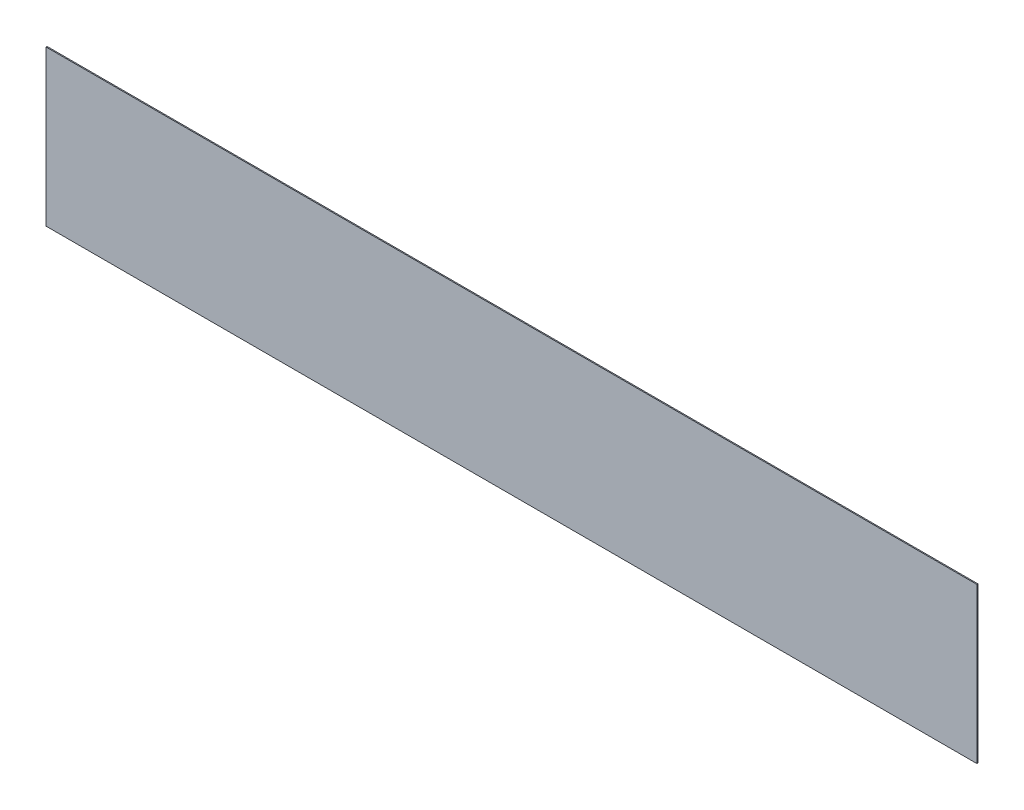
from build123d import *

# Parameters (mm, degrees)
SKETCH1_W      = 2286
SKETCH1_H      = 381
EXTRUDE1_DEPTH = 2.54


with BuildPart() as part:
    # Sketch1 → Extrude1 (new body)
    with BuildSketch(Plane.XY):
        with Locations((1143, 0)):
            Rectangle(SKETCH1_W, SKETCH1_H)
    extrude(amount=EXTRUDE1_DEPTH)


solid = part.part
